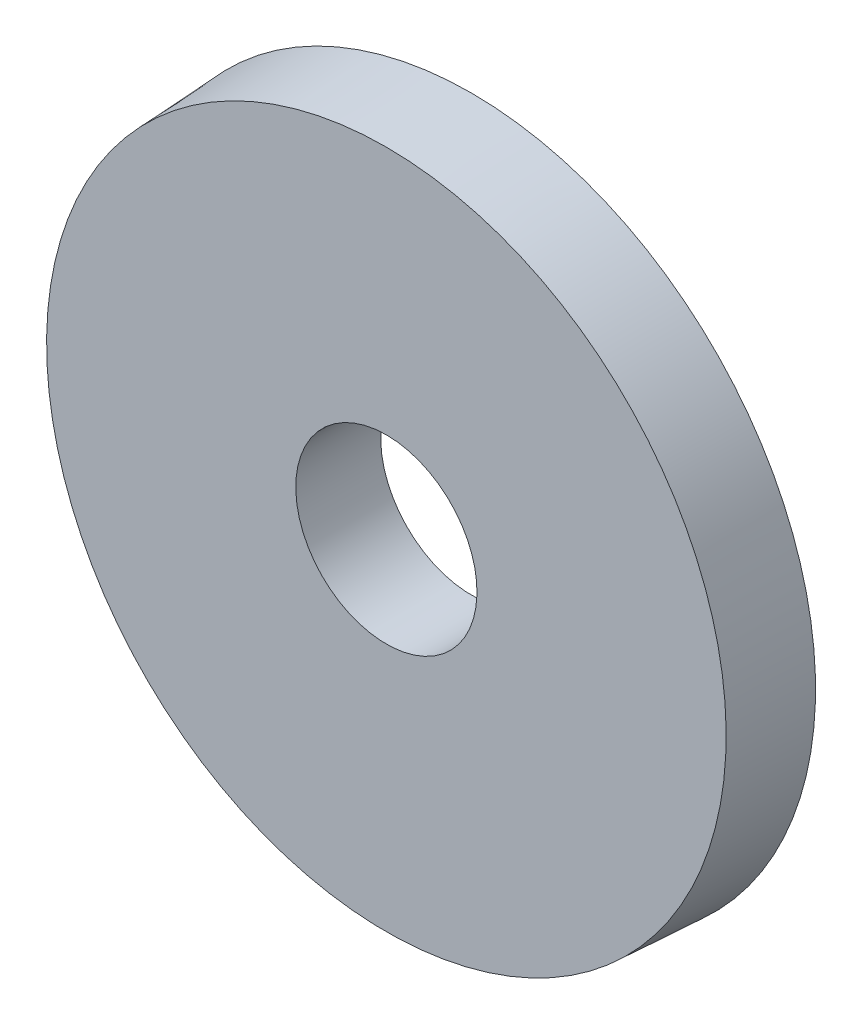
ISO-10303-21;
HEADER;
FILE_DESCRIPTION(('STEP AP214'),'2;1');
FILE_NAME('part.step','',(''),(''),'','','');
FILE_SCHEMA(('AUTOMOTIVE_DESIGN { 1 0 10303 214 1 1 1 1 }'));
ENDSEC;
DATA;
#1=APPLICATION_CONTEXT('core data for automotive mechanical design processes');
#2=APPLICATION_PROTOCOL_DEFINITION('international standard','automotive_design',2000,#1);
#3=PRODUCT_CONTEXT('',#1,'mechanical');
#4=PRODUCT('Part','Part','',(#3));
#5=PRODUCT_RELATED_PRODUCT_CATEGORY('part','',(#4));
#6=PRODUCT_DEFINITION_FORMATION('','',#4);
#7=PRODUCT_DEFINITION_CONTEXT('part definition',#1,'design');
#8=PRODUCT_DEFINITION('design','',#6,#7);
#9=PRODUCT_DEFINITION_SHAPE('','',#8);
#10=(LENGTH_UNIT() NAMED_UNIT(*) SI_UNIT(.MILLI.,.METRE.));
#11=(NAMED_UNIT(*) PLANE_ANGLE_UNIT() SI_UNIT($,.RADIAN.));
#12=(NAMED_UNIT(*) SI_UNIT($,.STERADIAN.) SOLID_ANGLE_UNIT());
#13=UNCERTAINTY_MEASURE_WITH_UNIT(LENGTH_MEASURE(1.E-05),#10,'distance_accuracy_value','');
#14=(GEOMETRIC_REPRESENTATION_CONTEXT(3) GLOBAL_UNCERTAINTY_ASSIGNED_CONTEXT((#13)) GLOBAL_UNIT_ASSIGNED_CONTEXT((#10,
#11,#12)) REPRESENTATION_CONTEXT('',''));
#15=CARTESIAN_POINT('',(0.,0.,0.));
#16=DIRECTION('',(0.,0.,1.));
#17=DIRECTION('',(1.,0.,0.));
#18=AXIS2_PLACEMENT_3D('',#15,#16,#17);
#19=CARTESIAN_POINT('',(-0.0022218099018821,-135.679575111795,1.5074999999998));
#20=DIRECTION('',(0.,0.,1.));
#21=DIRECTION('',(0.,1.,0.));
#22=AXIS2_PLACEMENT_3D('',#19,#20,#21);
#23=PLANE('',#22);
#24=CARTESIAN_POINT('',(-0.0022218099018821,-135.679575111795,1.5074999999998));
#25=DIRECTION('',(0.,0.,1.));
#26=DIRECTION('',(0.,1.,0.));
#27=AXIS2_PLACEMENT_3D('',#24,#25,#26);
#28=CIRCLE('',#27,6.03);
#29=CARTESIAN_POINT('',(-0.0022218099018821,-129.649575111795,1.5074999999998));
#30=VERTEX_POINT('',#29);
#31=EDGE_CURVE('E10',#30,#30,#28,.T.);
#32=ORIENTED_EDGE('',*,*,#31,.T.);
#33=EDGE_LOOP('',(#32));
#34=FACE_BOUND('',#33,.T.);
#35=CARTESIAN_POINT('',(-0.0022218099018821,-135.679575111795,1.5074999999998));
#36=DIRECTION('',(0.,0.,1.));
#37=DIRECTION('',(0.,1.,0.));
#38=AXIS2_PLACEMENT_3D('',#35,#36,#37);
#39=CIRCLE('',#38,1.608);
#40=CARTESIAN_POINT('',(-0.0022218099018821,-134.071575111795,1.5074999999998));
#41=VERTEX_POINT('',#40);
#42=EDGE_CURVE('E35',#41,#41,#39,.T.);
#43=ORIENTED_EDGE('',*,*,#42,.F.);
#44=EDGE_LOOP('',(#43));
#45=FACE_BOUND('',#44,.T.);
#46=ADVANCED_FACE('F14',(#34,#45),#23,.T.);
#47=CARTESIAN_POINT('',(-0.0022218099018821,-135.679575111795,-2.07137367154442E-13));
#48=DIRECTION('',(0.,0.,1.));
#49=DIRECTION('',(0.,1.,0.));
#50=AXIS2_PLACEMENT_3D('',#47,#48,#49);
#51=PLANE('',#50);
#52=CARTESIAN_POINT('',(-0.0022218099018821,-135.679575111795,-2.07028404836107E-13));
#53=DIRECTION('',(0.,0.,1.));
#54=DIRECTION('',(0.,1.,0.));
#55=AXIS2_PLACEMENT_3D('',#52,#53,#54);
#56=CIRCLE('',#55,6.10900472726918);
#57=CARTESIAN_POINT('',(-0.0022218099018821,-129.570570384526,-2.07028404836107E-13));
#58=VERTEX_POINT('',#57);
#59=EDGE_CURVE('E18',#58,#58,#56,.T.);
#60=ORIENTED_EDGE('',*,*,#59,.F.);
#61=EDGE_LOOP('',(#60));
#62=FACE_BOUND('',#61,.T.);
#63=CARTESIAN_POINT('',(-0.0022218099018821,-135.679575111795,-2.07137367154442E-13));
#64=DIRECTION('',(0.,0.,1.));
#65=DIRECTION('',(0.,1.,0.));
#66=AXIS2_PLACEMENT_3D('',#63,#64,#65);
#67=CIRCLE('',#66,1.608);
#68=CARTESIAN_POINT('',(-0.0022218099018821,-134.071575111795,-2.07137367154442E-13));
#69=VERTEX_POINT('',#68);
#70=EDGE_CURVE('E39',#69,#69,#67,.T.);
#71=ORIENTED_EDGE('',*,*,#70,.T.);
#72=EDGE_LOOP('',(#71));
#73=FACE_BOUND('',#72,.T.);
#74=ADVANCED_FACE('F50',(#62,#73),#51,.F.);
#75=CARTESIAN_POINT('',(-0.0022218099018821,-135.679575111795,1.5074999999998));
#76=DIRECTION('',(0.,0.,-1.));
#77=DIRECTION('',(0.,1.,0.));
#78=AXIS2_PLACEMENT_3D('',#75,#76,#77);
#79=CONICAL_SURFACE('',#78,6.03,0.0523598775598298);
#80=ORIENTED_EDGE('',*,*,#31,.F.);
#81=EDGE_LOOP('',(#80));
#82=FACE_BOUND('',#81,.T.);
#83=ORIENTED_EDGE('',*,*,#59,.T.);
#84=EDGE_LOOP('',(#83));
#85=FACE_BOUND('',#84,.T.);
#86=ADVANCED_FACE('F16',(#82,#85),#79,.T.);
#87=CARTESIAN_POINT('',(-0.0022218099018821,-135.679575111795,1.5074999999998));
#88=DIRECTION('',(0.,0.,-1.));
#89=DIRECTION('',(0.,-1.,0.));
#90=AXIS2_PLACEMENT_3D('',#87,#88,#89);
#91=CYLINDRICAL_SURFACE('',#90,1.608);
#92=ORIENTED_EDGE('',*,*,#42,.T.);
#93=EDGE_LOOP('',(#92));
#94=FACE_BOUND('',#93,.T.);
#95=ORIENTED_EDGE('',*,*,#70,.F.);
#96=EDGE_LOOP('',(#95));
#97=FACE_BOUND('',#96,.T.);
#98=ADVANCED_FACE('F52',(#94,#97),#91,.F.);
#99=CLOSED_SHELL('',(#46,#74,#86,#98));
#100=MANIFOLD_SOLID_BREP('B1',#99);
#101=ADVANCED_BREP_SHAPE_REPRESENTATION('',(#18,#100),#14);
#102=SHAPE_DEFINITION_REPRESENTATION(#9,#101);
ENDSEC;
END-ISO-10303-21;
